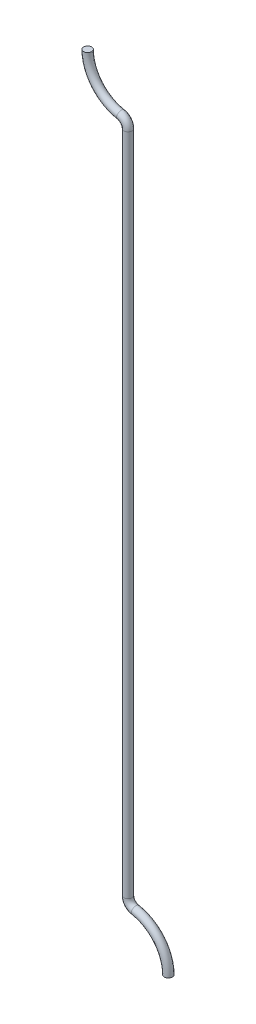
ISO-10303-21;
HEADER;
FILE_DESCRIPTION(('STEP AP214'),'2;1');
FILE_NAME('part.step','',(''),(''),'','','');
FILE_SCHEMA(('AUTOMOTIVE_DESIGN { 1 0 10303 214 1 1 1 1 }'));
ENDSEC;
DATA;
#1=APPLICATION_CONTEXT('core data for automotive mechanical design processes');
#2=APPLICATION_PROTOCOL_DEFINITION('international standard','automotive_design',2000,#1);
#3=PRODUCT_CONTEXT('',#1,'mechanical');
#4=PRODUCT('Part','Part','',(#3));
#5=PRODUCT_RELATED_PRODUCT_CATEGORY('part','',(#4));
#6=PRODUCT_DEFINITION_FORMATION('','',#4);
#7=PRODUCT_DEFINITION_CONTEXT('part definition',#1,'design');
#8=PRODUCT_DEFINITION('design','',#6,#7);
#9=PRODUCT_DEFINITION_SHAPE('','',#8);
#10=(LENGTH_UNIT() NAMED_UNIT(*) SI_UNIT(.MILLI.,.METRE.));
#11=(NAMED_UNIT(*) PLANE_ANGLE_UNIT() SI_UNIT($,.RADIAN.));
#12=(NAMED_UNIT(*) SI_UNIT($,.STERADIAN.) SOLID_ANGLE_UNIT());
#13=UNCERTAINTY_MEASURE_WITH_UNIT(LENGTH_MEASURE(1.E-05),#10,'distance_accuracy_value','');
#14=(GEOMETRIC_REPRESENTATION_CONTEXT(3) GLOBAL_UNCERTAINTY_ASSIGNED_CONTEXT((#13)) GLOBAL_UNIT_ASSIGNED_CONTEXT((#10,
#11,#12)) REPRESENTATION_CONTEXT('',''));
#15=CARTESIAN_POINT('',(0.,0.,0.));
#16=DIRECTION('',(0.,0.,1.));
#17=DIRECTION('',(1.,0.,0.));
#18=AXIS2_PLACEMENT_3D('',#15,#16,#17);
#19=CARTESIAN_POINT('',(-0.117592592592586,-84.855,0.));
#20=DIRECTION('',(0.,0.,-1.));
#21=DIRECTION('',(-1.,0.,0.));
#22=AXIS2_PLACEMENT_3D('',#19,#20,#21);
#23=TOROIDAL_SURFACE('',#22,9.00000000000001,0.9);
#24=CARTESIAN_POINT('',(1.51877104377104,-76.0050105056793,0.));
#25=DIRECTION('',(-0.983332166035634,0.181818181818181,0.));
#26=DIRECTION('',(0.,0.,1.));
#27=AXIS2_PLACEMENT_3D('',#24,#25,#26);
#28=CIRCLE('',#27,0.9);
#29=CARTESIAN_POINT('',(1.68240740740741,-75.1200115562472,0.));
#30=VERTEX_POINT('',#29);
#31=EDGE_CURVE('E30',#30,#30,#28,.T.);
#32=CARTESIAN_POINT('',(8.88240740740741,-84.855,0.));
#33=DIRECTION('',(0.,1.,0.));
#34=DIRECTION('',(0.,0.,1.));
#35=AXIS2_PLACEMENT_3D('',#32,#33,#34);
#36=CIRCLE('',#35,0.9);
#37=CARTESIAN_POINT('',(9.78240740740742,-84.855,0.));
#38=VERTEX_POINT('',#37);
#39=EDGE_CURVE('E10',#38,#38,#36,.T.);
#40=CARTESIAN_POINT('',(-0.117592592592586,-84.855,0.));
#41=DIRECTION('',(0.,0.,-1.));
#42=DIRECTION('',(-1.,0.,0.));
#43=AXIS2_PLACEMENT_3D('',#40,#41,#42);
#44=CIRCLE('',#43,9.90000000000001);
#45=EDGE_CURVE('',#30,#38,#44,.T.);
#46=ORIENTED_EDGE('',*,*,#31,.F.);
#47=ORIENTED_EDGE('',*,*,#39,.T.);
#48=ORIENTED_EDGE('',*,*,#45,.T.);
#49=ORIENTED_EDGE('',*,*,#45,.F.);
#50=EDGE_LOOP('',(#46,#48,#47,#49));
#51=FACE_BOUND('',#50,.T.);
#52=ADVANCED_FACE('F24',(#51),#23,.T.);
#53=CARTESIAN_POINT('',(1.88240740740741,-74.038346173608,0.));
#54=DIRECTION('',(0.,0.,1.));
#55=DIRECTION('',(1.,0.,0.));
#56=AXIS2_PLACEMENT_3D('',#53,#54,#55);
#57=TOROIDAL_SURFACE('',#56,1.99999999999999,0.9);
#58=CARTESIAN_POINT('',(-0.117592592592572,-74.038346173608,0.));
#59=DIRECTION('',(0.,1.,0.));
#60=DIRECTION('',(0.,0.,1.));
#61=AXIS2_PLACEMENT_3D('',#58,#59,#60);
#62=CIRCLE('',#61,0.9);
#63=CARTESIAN_POINT('',(-0.117592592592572,-74.038346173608,0.9));
#64=VERTEX_POINT('',#63);
#65=EDGE_CURVE('E34',#64,#64,#62,.T.);
#66=ORIENTED_EDGE('',*,*,#65,.F.);
#67=EDGE_LOOP('',(#66));
#68=FACE_BOUND('',#67,.T.);
#69=ORIENTED_EDGE('',*,*,#31,.T.);
#70=EDGE_LOOP('',(#69));
#71=FACE_BOUND('',#70,.T.);
#72=ADVANCED_FACE('F70',(#68,#71),#57,.T.);
#73=CARTESIAN_POINT('',(-0.117592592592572,74.038346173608,0.));
#74=DIRECTION('',(0.,-1.,0.));
#75=DIRECTION('',(0.,0.,-1.));
#76=AXIS2_PLACEMENT_3D('',#73,#74,#75);
#77=CYLINDRICAL_SURFACE('',#76,0.9);
#78=CARTESIAN_POINT('',(-0.117592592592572,74.038346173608,0.));
#79=DIRECTION('',(0.,1.,0.));
#80=DIRECTION('',(0.,0.,1.));
#81=AXIS2_PLACEMENT_3D('',#78,#79,#80);
#82=CIRCLE('',#81,0.9);
#83=CARTESIAN_POINT('',(0.782407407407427,74.038346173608,0.));
#84=VERTEX_POINT('',#83);
#85=EDGE_CURVE('E38',#84,#84,#82,.T.);
#86=ORIENTED_EDGE('',*,*,#85,.F.);
#87=EDGE_LOOP('',(#86));
#88=FACE_BOUND('',#87,.T.);
#89=ORIENTED_EDGE('',*,*,#65,.T.);
#90=EDGE_LOOP('',(#89));
#91=FACE_BOUND('',#90,.T.);
#92=ADVANCED_FACE('F64',(#88,#91),#77,.T.);
#93=CARTESIAN_POINT('',(-2.11759259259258,74.038346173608,0.));
#94=DIRECTION('',(0.,0.,-1.));
#95=DIRECTION('',(-1.,0.,0.));
#96=AXIS2_PLACEMENT_3D('',#93,#94,#95);
#97=TOROIDAL_SURFACE('',#96,2.00000000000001,0.9);
#98=CARTESIAN_POINT('',(-1.75395622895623,76.0050105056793,0.));
#99=DIRECTION('',(-0.983332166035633,0.181818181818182,0.));
#100=DIRECTION('',(0.,0.,1.));
#101=AXIS2_PLACEMENT_3D('',#98,#99,#100);
#102=CIRCLE('',#101,0.9);
#103=CARTESIAN_POINT('',(-1.59031986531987,76.8900094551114,0.));
#104=VERTEX_POINT('',#103);
#105=EDGE_CURVE('E43',#104,#104,#102,.T.);
#106=CARTESIAN_POINT('',(-2.11759259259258,74.038346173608,0.));
#107=DIRECTION('',(0.,0.,-1.));
#108=DIRECTION('',(-1.,0.,0.));
#109=AXIS2_PLACEMENT_3D('',#106,#107,#108);
#110=CIRCLE('',#109,2.90000000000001);
#111=EDGE_CURVE('',#104,#84,#110,.T.);
#112=ORIENTED_EDGE('',*,*,#105,.F.);
#113=ORIENTED_EDGE('',*,*,#85,.T.);
#114=ORIENTED_EDGE('',*,*,#111,.T.);
#115=ORIENTED_EDGE('',*,*,#111,.F.);
#116=EDGE_LOOP('',(#112,#114,#113,#115));
#117=FACE_BOUND('',#116,.T.);
#118=ADVANCED_FACE('F55',(#117),#97,.T.);
#119=CARTESIAN_POINT('',(-0.117592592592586,84.855,0.));
#120=DIRECTION('',(0.,0.,-1.));
#121=DIRECTION('',(-1.,0.,0.));
#122=AXIS2_PLACEMENT_3D('',#119,#120,#121);
#123=TOROIDAL_SURFACE('',#122,8.99999999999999,0.9);
#124=ORIENTED_EDGE('',*,*,#105,.T.);
#125=EDGE_LOOP('',(#124));
#126=FACE_BOUND('',#125,.T.);
#127=CARTESIAN_POINT('',(-9.11759259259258,84.855,0.));
#128=DIRECTION('',(0.,1.,0.));
#129=DIRECTION('',(0.,0.,1.));
#130=AXIS2_PLACEMENT_3D('',#127,#128,#129);
#131=CIRCLE('',#130,0.9);
#132=CARTESIAN_POINT('',(-9.11759259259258,84.855,0.9));
#133=VERTEX_POINT('',#132);
#134=EDGE_CURVE('E46',#133,#133,#131,.T.);
#135=ORIENTED_EDGE('',*,*,#134,.F.);
#136=EDGE_LOOP('',(#135));
#137=FACE_BOUND('',#136,.T.);
#138=ADVANCED_FACE('F52',(#126,#137),#123,.T.);
#139=CARTESIAN_POINT('',(8.88240740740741,-84.855,0.));
#140=DIRECTION('',(0.,1.,0.));
#141=DIRECTION('',(0.,0.,1.));
#142=AXIS2_PLACEMENT_3D('',#139,#140,#141);
#143=PLANE('',#142);
#144=ORIENTED_EDGE('',*,*,#39,.F.);
#145=EDGE_LOOP('',(#144));
#146=FACE_BOUND('',#145,.T.);
#147=ADVANCED_FACE('F54',(#146),#143,.F.);
#148=CARTESIAN_POINT('',(-9.11759259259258,84.855,0.));
#149=DIRECTION('',(0.,1.,0.));
#150=DIRECTION('',(0.,0.,1.));
#151=AXIS2_PLACEMENT_3D('',#148,#149,#150);
#152=PLANE('',#151);
#153=ORIENTED_EDGE('',*,*,#134,.T.);
#154=EDGE_LOOP('',(#153));
#155=FACE_BOUND('',#154,.T.);
#156=ADVANCED_FACE('F50',(#155),#152,.T.);
#157=CLOSED_SHELL('',(#52,#72,#92,#118,#138,#147,#156));
#158=MANIFOLD_SOLID_BREP('B2',#157);
#159=ADVANCED_BREP_SHAPE_REPRESENTATION('',(#18,#158),#14);
#160=SHAPE_DEFINITION_REPRESENTATION(#9,#159);
ENDSEC;
END-ISO-10303-21;
